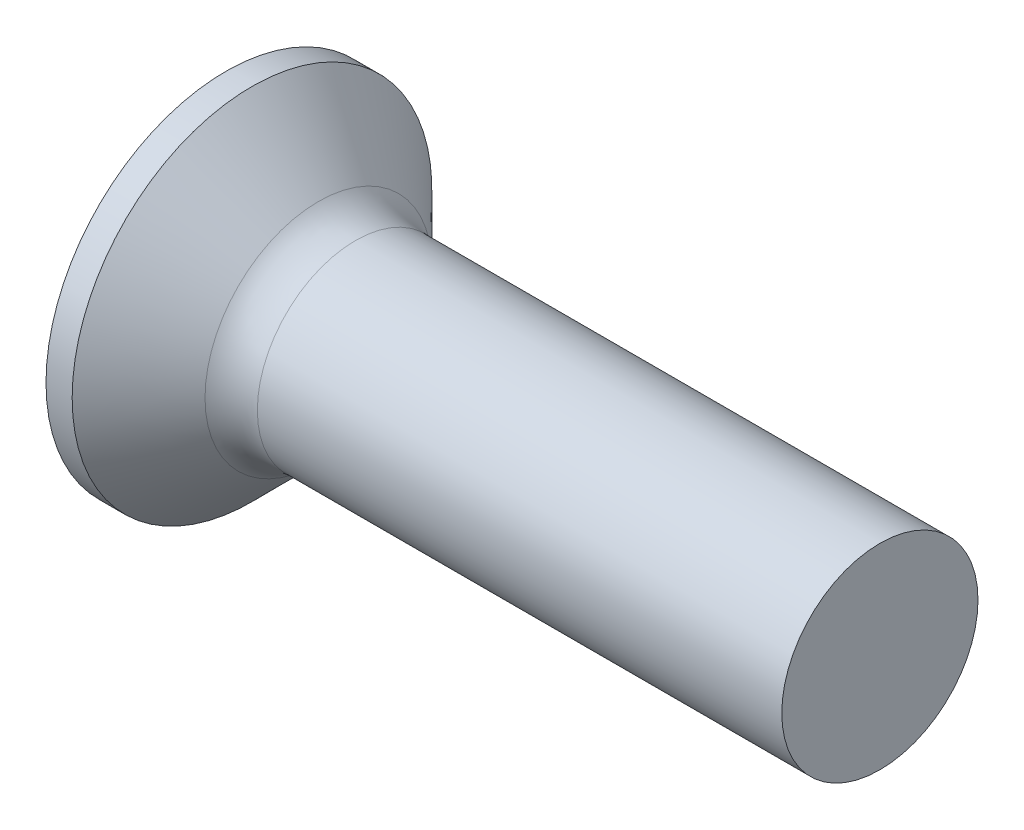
from build123d import *

# Parameters (mm, degrees)
FILLET1_R    = 0.8
RECPAT_COUNT = 2
RECPAT_ANGLE = 90


with BuildPart() as part:
    # BodySke → Base-Revolve (revolve)
    with BuildSketch(Plane.XY, mode=Mode.PRIVATE) as base_revolve_sk:
        Polygon((0, 0), (0, 2.75), (0.4, 2.75), (1.65, 1.5), (10, 1.5), (10, 0), align=None)
    revolve(base_revolve_sk.sketch.rotate(Axis((-6.35, 0, 0), (1, 0, 0)), 90), axis=Axis((-6.35, 0, 0), (1, 0, 0)))

    # Fillet1
    fillet1_edges = [part.edges().sort_by_distance(p)[0] for p in [
        (1.65, 0, -1.5),
    ]]
    fillet(fillet1_edges, radius=FILLET1_R)

    # Sketch3 → Recess section 0
    with BuildSketch(Plane.ZY):
        with BuildLine():
            Line((-0.37, 1.5), (0.37, 1.5))
            Line((0.37, 1.5), (0.37, -1.5))
            Line((0.37, -1.5), (-0.37, -1.5))
            Line((-0.37, -1.5), (-0.37, 1.5))
        make_face()
    # Sketch4 → Recess section 1
    with BuildSketch(Plane.ZY.offset(-2.01)):
        with BuildLine():
            Line((-0.37, 0.497851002), (0.37, 0.497851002))
            Line((0.37, 0.497851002), (0.37, -0.497851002))
            Line((0.37, -0.497851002), (-0.37, -0.497851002))
            Line((-0.37, -0.497851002), (-0.37, 0.497851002))
        make_face()
    recess = loft(mode=Mode.SUBTRACT)

    # RecPat: Recess ×2 about axis
    recpat_axis = Axis((0, 0, 0), (1, 0, 0))
    for i in range(1, RECPAT_COUNT):
        add(recess.rotate(recpat_axis, i * RECPAT_ANGLE / (RECPAT_COUNT - 1)), mode=Mode.SUBTRACT)

    # RecCorSke → RecessCore (revolve, cut)
    with BuildSketch(Plane.XY, mode=Mode.PRIVATE) as recesscore_sk:
        Polygon((0, 0), (0, 0.696552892), (2.01, 0.556), (2.190655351, 0), align=None)
    revolve(recesscore_sk.sketch.rotate(Axis((-3.175, 0, 0), (1, 0, 0)), 90), axis=Axis((-3.175, 0, 0), (1, 0, 0)), mode=Mode.SUBTRACT)


solid = part.part
